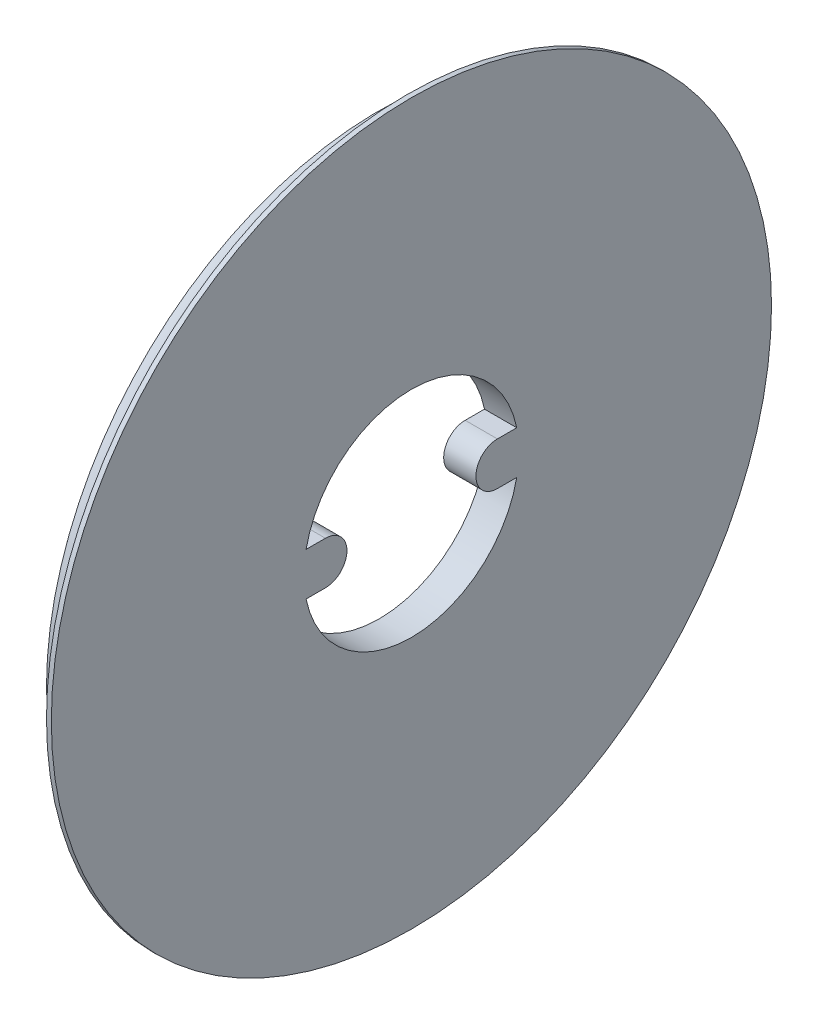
ISO-10303-21;
HEADER;
FILE_DESCRIPTION(('STEP AP214'),'2;1');
FILE_NAME('part.step','',(''),(''),'','','');
FILE_SCHEMA(('AUTOMOTIVE_DESIGN { 1 0 10303 214 1 1 1 1 }'));
ENDSEC;
DATA;
#1=APPLICATION_CONTEXT('core data for automotive mechanical design processes');
#2=APPLICATION_PROTOCOL_DEFINITION('international standard','automotive_design',2000,#1);
#3=PRODUCT_CONTEXT('',#1,'mechanical');
#4=PRODUCT('Part','Part','',(#3));
#5=PRODUCT_RELATED_PRODUCT_CATEGORY('part','',(#4));
#6=PRODUCT_DEFINITION_FORMATION('','',#4);
#7=PRODUCT_DEFINITION_CONTEXT('part definition',#1,'design');
#8=PRODUCT_DEFINITION('design','',#6,#7);
#9=PRODUCT_DEFINITION_SHAPE('','',#8);
#10=(LENGTH_UNIT() NAMED_UNIT(*) SI_UNIT(.MILLI.,.METRE.));
#11=(NAMED_UNIT(*) PLANE_ANGLE_UNIT() SI_UNIT($,.RADIAN.));
#12=(NAMED_UNIT(*) SI_UNIT($,.STERADIAN.) SOLID_ANGLE_UNIT());
#13=UNCERTAINTY_MEASURE_WITH_UNIT(LENGTH_MEASURE(1.E-05),#10,'distance_accuracy_value','');
#14=(GEOMETRIC_REPRESENTATION_CONTEXT(3) GLOBAL_UNCERTAINTY_ASSIGNED_CONTEXT((#13)) GLOBAL_UNIT_ASSIGNED_CONTEXT((#10,
#11,#12)) REPRESENTATION_CONTEXT('',''));
#15=CARTESIAN_POINT('',(0.,0.,0.));
#16=DIRECTION('',(0.,0.,1.));
#17=DIRECTION('',(1.,0.,0.));
#18=AXIS2_PLACEMENT_3D('',#15,#16,#17);
#19=CARTESIAN_POINT('',(11.9999999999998,66.9999999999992,0.));
#20=DIRECTION('',(1.,0.,0.));
#21=DIRECTION('',(0.,0.,-1.));
#22=AXIS2_PLACEMENT_3D('',#19,#20,#21);
#23=PLANE('',#22);
#24=CARTESIAN_POINT('',(11.9999999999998,0.,-16.));
#25=DIRECTION('',(1.,0.,0.));
#26=DIRECTION('',(0.,0.,1.));
#27=AXIS2_PLACEMENT_3D('',#24,#25,#26);
#28=CIRCLE('',#27,4.);
#29=CARTESIAN_POINT('',(11.9999999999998,4.,-16.));
#30=VERTEX_POINT('',#29);
#31=CARTESIAN_POINT('',(11.9999999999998,-4.,-16.));
#32=VERTEX_POINT('',#31);
#33=EDGE_CURVE('E103',#30,#32,#28,.T.);
#34=ORIENTED_EDGE('',*,*,#33,.T.);
#35=DIRECTION('',(0.,0.,-1.));
#36=VECTOR('',#35,1.);
#37=CARTESIAN_POINT('',(11.9999999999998,-4.,-19.5959179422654));
#38=LINE('',#37,#36);
#39=CARTESIAN_POINT('',(11.9999999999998,-4.,-19.5959179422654));
#40=VERTEX_POINT('',#39);
#41=EDGE_CURVE('E112',#32,#40,#38,.T.);
#42=ORIENTED_EDGE('',*,*,#41,.T.);
#43=CARTESIAN_POINT('',(11.9999999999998,0.,0.));
#44=DIRECTION('',(-1.,0.,0.));
#45=DIRECTION('',(0.,0.,1.));
#46=AXIS2_PLACEMENT_3D('',#43,#44,#45);
#47=CIRCLE('',#46,20.);
#48=CARTESIAN_POINT('',(11.9999999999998,-4.,19.5959179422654));
#49=VERTEX_POINT('',#48);
#50=EDGE_CURVE('E51',#40,#49,#47,.T.);
#51=ORIENTED_EDGE('',*,*,#50,.T.);
#52=DIRECTION('',(0.,0.,-1.));
#53=VECTOR('',#52,1.);
#54=CARTESIAN_POINT('',(11.9999999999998,-4.,19.5959179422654));
#55=LINE('',#54,#53);
#56=CARTESIAN_POINT('',(11.9999999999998,-4.,16.));
#57=VERTEX_POINT('',#56);
#58=EDGE_CURVE('E129',#49,#57,#55,.T.);
#59=ORIENTED_EDGE('',*,*,#58,.T.);
#60=CARTESIAN_POINT('',(11.9999999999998,0.,16.));
#61=DIRECTION('',(1.,0.,0.));
#62=DIRECTION('',(0.,0.,-1.));
#63=AXIS2_PLACEMENT_3D('',#60,#61,#62);
#64=CIRCLE('',#63,4.);
#65=CARTESIAN_POINT('',(11.9999999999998,4.,16.));
#66=VERTEX_POINT('',#65);
#67=EDGE_CURVE('E132',#57,#66,#64,.T.);
#68=ORIENTED_EDGE('',*,*,#67,.T.);
#69=DIRECTION('',(0.,0.,1.));
#70=VECTOR('',#69,1.);
#71=CARTESIAN_POINT('',(11.9999999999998,4.,19.5959179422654));
#72=LINE('',#71,#70);
#73=CARTESIAN_POINT('',(11.9999999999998,4.,19.5959179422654));
#74=VERTEX_POINT('',#73);
#75=EDGE_CURVE('E135',#66,#74,#72,.T.);
#76=ORIENTED_EDGE('',*,*,#75,.T.);
#77=CARTESIAN_POINT('',(11.9999999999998,0.,0.));
#78=DIRECTION('',(-1.,0.,0.));
#79=DIRECTION('',(0.,0.,1.));
#80=AXIS2_PLACEMENT_3D('',#77,#78,#79);
#81=CIRCLE('',#80,20.);
#82=CARTESIAN_POINT('',(11.9999999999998,4.,-19.5959179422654));
#83=VERTEX_POINT('',#82);
#84=EDGE_CURVE('E138',#74,#83,#81,.T.);
#85=ORIENTED_EDGE('',*,*,#84,.T.);
#86=DIRECTION('',(0.,0.,1.));
#87=VECTOR('',#86,1.);
#88=CARTESIAN_POINT('',(11.9999999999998,4.,-19.5959179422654));
#89=LINE('',#88,#87);
#90=EDGE_CURVE('E109',#83,#30,#89,.T.);
#91=ORIENTED_EDGE('',*,*,#90,.T.);
#92=EDGE_LOOP('',(#34,#42,#51,#59,#68,#76,#85,#91));
#93=FACE_BOUND('',#92,.T.);
#94=CARTESIAN_POINT('',(11.9999999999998,-7.77547884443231E-13,0.));
#95=DIRECTION('',(-1.,0.,0.));
#96=DIRECTION('',(0.,0.,1.));
#97=AXIS2_PLACEMENT_3D('',#94,#95,#96);
#98=CIRCLE('',#97,67.);
#99=CARTESIAN_POINT('',(11.9999999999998,-7.77547884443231E-13,67.));
#100=VERTEX_POINT('',#99);
#101=EDGE_CURVE('E11',#100,#100,#98,.T.);
#102=ORIENTED_EDGE('',*,*,#101,.F.);
#103=EDGE_LOOP('',(#102));
#104=FACE_BOUND('',#103,.T.);
#105=ADVANCED_FACE('F37',(#93,#104),#23,.T.);
#106=CARTESIAN_POINT('',(-19.0782144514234,-7.77547884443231E-13,0.));
#107=DIRECTION('',(-1.,0.,0.));
#108=DIRECTION('',(0.,0.,1.));
#109=AXIS2_PLACEMENT_3D('',#106,#107,#108);
#110=CYLINDRICAL_SURFACE('',#109,67.);
#111=ORIENTED_EDGE('',*,*,#101,.T.);
#112=EDGE_LOOP('',(#111));
#113=FACE_BOUND('',#112,.T.);
#114=CARTESIAN_POINT('',(11.0999999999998,-7.77547884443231E-13,0.));
#115=DIRECTION('',(-1.,0.,0.));
#116=DIRECTION('',(0.,0.,1.));
#117=AXIS2_PLACEMENT_3D('',#114,#115,#116);
#118=CIRCLE('',#117,67.);
#119=CARTESIAN_POINT('',(11.0999999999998,-7.77547884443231E-13,67.));
#120=VERTEX_POINT('',#119);
#121=EDGE_CURVE('E44',#120,#120,#118,.T.);
#122=ORIENTED_EDGE('',*,*,#121,.F.);
#123=EDGE_LOOP('',(#122));
#124=FACE_BOUND('',#123,.T.);
#125=ADVANCED_FACE('F180',(#113,#124),#110,.T.);
#126=CARTESIAN_POINT('',(5.99999999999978,-7.7715611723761E-13,0.));
#127=DIRECTION('',(-1.,0.,0.));
#128=DIRECTION('',(0.,0.,1.));
#129=AXIS2_PLACEMENT_3D('',#126,#127,#128);
#130=TOROIDAL_SURFACE('',#129,67.,5.1);
#131=ORIENTED_EDGE('',*,*,#121,.T.);
#132=EDGE_LOOP('',(#131));
#133=FACE_BOUND('',#132,.T.);
#134=CARTESIAN_POINT('',(5.99999999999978,-7.77547884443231E-13,0.));
#135=DIRECTION('',(-1.,0.,0.));
#136=DIRECTION('',(0.,0.,1.));
#137=AXIS2_PLACEMENT_3D('',#134,#135,#136);
#138=CIRCLE('',#137,61.9);
#139=CARTESIAN_POINT('',(5.99999999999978,-7.77547884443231E-13,61.9));
#140=VERTEX_POINT('',#139);
#141=EDGE_CURVE('E161',#140,#140,#138,.T.);
#142=ORIENTED_EDGE('',*,*,#141,.F.);
#143=EDGE_LOOP('',(#142));
#144=FACE_BOUND('',#143,.T.);
#145=ADVANCED_FACE('F177',(#133,#144),#130,.F.);
#146=CARTESIAN_POINT('',(5.99999999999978,61.8999999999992,0.));
#147=DIRECTION('',(1.,0.,0.));
#148=DIRECTION('',(0.,0.,-1.));
#149=AXIS2_PLACEMENT_3D('',#146,#147,#148);
#150=PLANE('',#149);
#151=CARTESIAN_POINT('',(5.99999999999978,15.0000000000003,-25.980762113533));
#152=DIRECTION('',(-1.,0.,0.));
#153=DIRECTION('',(0.,0.,1.));
#154=AXIS2_PLACEMENT_3D('',#151,#152,#153);
#155=CIRCLE('',#154,1.1);
#156=CARTESIAN_POINT('',(5.99999999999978,15.0000000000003,-24.880762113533));
#157=VERTEX_POINT('',#156);
#158=EDGE_CURVE('E273',#157,#157,#155,.T.);
#159=ORIENTED_EDGE('',*,*,#158,.F.);
#160=EDGE_LOOP('',(#159));
#161=FACE_BOUND('',#160,.T.);
#162=CARTESIAN_POINT('',(5.99999999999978,-15.0000000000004,-25.9807621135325));
#163=DIRECTION('',(-1.,0.,0.));
#164=DIRECTION('',(0.,0.,1.));
#165=AXIS2_PLACEMENT_3D('',#162,#163,#164);
#166=CIRCLE('',#165,1.100000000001);
#167=CARTESIAN_POINT('',(5.99999999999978,-15.0000000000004,-24.8807621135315));
#168=VERTEX_POINT('',#167);
#169=EDGE_CURVE('E272',#168,#168,#166,.T.);
#170=ORIENTED_EDGE('',*,*,#169,.F.);
#171=EDGE_LOOP('',(#170));
#172=FACE_BOUND('',#171,.T.);
#173=CARTESIAN_POINT('',(5.99999999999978,-30.,8.52170513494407E-13));
#174=DIRECTION('',(-1.,0.,0.));
#175=DIRECTION('',(0.,0.,1.));
#176=AXIS2_PLACEMENT_3D('',#173,#174,#175);
#177=CIRCLE('',#176,1.10000000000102);
#178=CARTESIAN_POINT('',(5.99999999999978,-30.,1.10000000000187));
#179=VERTEX_POINT('',#178);
#180=EDGE_CURVE('E282',#179,#179,#177,.T.);
#181=ORIENTED_EDGE('',*,*,#180,.F.);
#182=EDGE_LOOP('',(#181));
#183=FACE_BOUND('',#182,.T.);
#184=CARTESIAN_POINT('',(5.99999999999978,-15.0000000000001,25.9807621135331));
#185=DIRECTION('',(-1.,0.,0.));
#186=DIRECTION('',(0.,0.,1.));
#187=AXIS2_PLACEMENT_3D('',#184,#185,#186);
#188=CIRCLE('',#187,1.1);
#189=CARTESIAN_POINT('',(5.99999999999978,-15.0000000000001,27.0807621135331));
#190=VERTEX_POINT('',#189);
#191=EDGE_CURVE('E287',#190,#190,#188,.T.);
#192=ORIENTED_EDGE('',*,*,#191,.F.);
#193=EDGE_LOOP('',(#192));
#194=FACE_BOUND('',#193,.T.);
#195=CARTESIAN_POINT('',(5.99999999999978,14.9999999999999,25.9807621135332));
#196=DIRECTION('',(-1.,0.,0.));
#197=DIRECTION('',(0.,0.,1.));
#198=AXIS2_PLACEMENT_3D('',#195,#196,#197);
#199=CIRCLE('',#198,1.1);
#200=CARTESIAN_POINT('',(5.99999999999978,14.9999999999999,27.0807621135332));
#201=VERTEX_POINT('',#200);
#202=EDGE_CURVE('E293',#201,#201,#199,.T.);
#203=ORIENTED_EDGE('',*,*,#202,.F.);
#204=EDGE_LOOP('',(#203));
#205=FACE_BOUND('',#204,.T.);
#206=CARTESIAN_POINT('',(5.99999999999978,30.,0.));
#207=DIRECTION('',(-1.,0.,0.));
#208=DIRECTION('',(0.,0.,1.));
#209=AXIS2_PLACEMENT_3D('',#206,#207,#208);
#210=CIRCLE('',#209,1.1);
#211=CARTESIAN_POINT('',(5.99999999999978,30.,1.1));
#212=VERTEX_POINT('',#211);
#213=EDGE_CURVE('E125',#212,#212,#210,.T.);
#214=ORIENTED_EDGE('',*,*,#213,.F.);
#215=EDGE_LOOP('',(#214));
#216=FACE_BOUND('',#215,.T.);
#217=DIRECTION('',(0.,0.,-1.));
#218=VECTOR('',#217,1.);
#219=CARTESIAN_POINT('',(5.99999999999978,-4.,-19.5959179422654));
#220=LINE('',#219,#218);
#221=CARTESIAN_POINT('',(5.99999999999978,-4.,-16.));
#222=VERTEX_POINT('',#221);
#223=CARTESIAN_POINT('',(5.99999999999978,-4.,-19.5959179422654));
#224=VERTEX_POINT('',#223);
#225=EDGE_CURVE('E142',#222,#224,#220,.T.);
#226=ORIENTED_EDGE('',*,*,#225,.F.);
#227=CARTESIAN_POINT('',(5.99999999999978,0.,-16.));
#228=DIRECTION('',(1.,0.,0.));
#229=DIRECTION('',(0.,0.,1.));
#230=AXIS2_PLACEMENT_3D('',#227,#228,#229);
#231=CIRCLE('',#230,4.);
#232=CARTESIAN_POINT('',(5.99999999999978,4.,-16.));
#233=VERTEX_POINT('',#232);
#234=EDGE_CURVE('E59',#233,#222,#231,.T.);
#235=ORIENTED_EDGE('',*,*,#234,.F.);
#236=DIRECTION('',(0.,0.,1.));
#237=VECTOR('',#236,1.);
#238=CARTESIAN_POINT('',(5.99999999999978,4.,-19.5959179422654));
#239=LINE('',#238,#237);
#240=CARTESIAN_POINT('',(5.99999999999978,4.,-19.5959179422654));
#241=VERTEX_POINT('',#240);
#242=EDGE_CURVE('E119',#241,#233,#239,.T.);
#243=ORIENTED_EDGE('',*,*,#242,.F.);
#244=CARTESIAN_POINT('',(5.99999999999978,0.,0.));
#245=DIRECTION('',(-1.,0.,0.));
#246=DIRECTION('',(0.,0.,1.));
#247=AXIS2_PLACEMENT_3D('',#244,#245,#246);
#248=CIRCLE('',#247,20.);
#249=CARTESIAN_POINT('',(5.99999999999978,4.,19.5959179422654));
#250=VERTEX_POINT('',#249);
#251=EDGE_CURVE('E122',#250,#241,#248,.T.);
#252=ORIENTED_EDGE('',*,*,#251,.F.);
#253=DIRECTION('',(0.,0.,1.));
#254=VECTOR('',#253,1.);
#255=CARTESIAN_POINT('',(5.99999999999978,4.,19.5959179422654));
#256=LINE('',#255,#254);
#257=CARTESIAN_POINT('',(5.99999999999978,4.,16.));
#258=VERTEX_POINT('',#257);
#259=EDGE_CURVE('E154',#258,#250,#256,.T.);
#260=ORIENTED_EDGE('',*,*,#259,.F.);
#261=CARTESIAN_POINT('',(5.99999999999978,0.,16.));
#262=DIRECTION('',(1.,0.,0.));
#263=DIRECTION('',(0.,0.,-1.));
#264=AXIS2_PLACEMENT_3D('',#261,#262,#263);
#265=CIRCLE('',#264,4.);
#266=CARTESIAN_POINT('',(5.99999999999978,-4.,16.));
#267=VERTEX_POINT('',#266);
#268=EDGE_CURVE('E151',#267,#258,#265,.T.);
#269=ORIENTED_EDGE('',*,*,#268,.F.);
#270=DIRECTION('',(0.,0.,-1.));
#271=VECTOR('',#270,1.);
#272=CARTESIAN_POINT('',(5.99999999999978,-4.,19.5959179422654));
#273=LINE('',#272,#271);
#274=CARTESIAN_POINT('',(5.99999999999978,-4.,19.5959179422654));
#275=VERTEX_POINT('',#274);
#276=EDGE_CURVE('E148',#275,#267,#273,.T.);
#277=ORIENTED_EDGE('',*,*,#276,.F.);
#278=CARTESIAN_POINT('',(5.99999999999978,0.,0.));
#279=DIRECTION('',(-1.,0.,0.));
#280=DIRECTION('',(0.,0.,1.));
#281=AXIS2_PLACEMENT_3D('',#278,#279,#280);
#282=CIRCLE('',#281,20.);
#283=EDGE_CURVE('E145',#224,#275,#282,.T.);
#284=ORIENTED_EDGE('',*,*,#283,.F.);
#285=EDGE_LOOP('',(#226,#235,#243,#252,#260,#269,#277,#284));
#286=FACE_BOUND('',#285,.T.);
#287=ORIENTED_EDGE('',*,*,#141,.T.);
#288=EDGE_LOOP('',(#287));
#289=FACE_BOUND('',#288,.T.);
#290=ADVANCED_FACE('F187',(#161,#172,#183,#194,#205,#216,#286,#289),#150,.F.);
#291=CARTESIAN_POINT('',(11.9999999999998,0.,-16.));
#292=DIRECTION('',(-1.,0.,0.));
#293=DIRECTION('',(0.,0.,1.));
#294=AXIS2_PLACEMENT_3D('',#291,#292,#293);
#295=CYLINDRICAL_SURFACE('',#294,4.);
#296=ORIENTED_EDGE('',*,*,#234,.T.);
#297=DIRECTION('',(-1.,0.,0.));
#298=VECTOR('',#297,1.);
#299=CARTESIAN_POINT('',(11.9999999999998,-4.,-16.));
#300=LINE('',#299,#298);
#301=EDGE_CURVE('E99',#32,#222,#300,.T.);
#302=ORIENTED_EDGE('',*,*,#301,.F.);
#303=ORIENTED_EDGE('',*,*,#33,.F.);
#304=DIRECTION('',(-1.,0.,0.));
#305=VECTOR('',#304,1.);
#306=CARTESIAN_POINT('',(11.9999999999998,4.,-16.));
#307=LINE('',#306,#305);
#308=EDGE_CURVE('E159',#30,#233,#307,.T.);
#309=ORIENTED_EDGE('',*,*,#308,.T.);
#310=EDGE_LOOP('',(#296,#302,#303,#309));
#311=FACE_BOUND('',#310,.T.);
#312=ADVANCED_FACE('F101',(#311),#295,.T.);
#313=CARTESIAN_POINT('',(11.9999999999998,4.,-19.5959179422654));
#314=DIRECTION('',(0.,-1.,0.));
#315=DIRECTION('',(0.,0.,-1.));
#316=AXIS2_PLACEMENT_3D('',#313,#314,#315);
#317=PLANE('',#316);
#318=ORIENTED_EDGE('',*,*,#242,.T.);
#319=ORIENTED_EDGE('',*,*,#308,.F.);
#320=ORIENTED_EDGE('',*,*,#90,.F.);
#321=DIRECTION('',(-1.,0.,0.));
#322=VECTOR('',#321,1.);
#323=CARTESIAN_POINT('',(11.9999999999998,4.,-19.5959179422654));
#324=LINE('',#323,#322);
#325=EDGE_CURVE('E162',#83,#241,#324,.T.);
#326=ORIENTED_EDGE('',*,*,#325,.T.);
#327=EDGE_LOOP('',(#318,#319,#320,#326));
#328=FACE_BOUND('',#327,.T.);
#329=ADVANCED_FACE('F195',(#328),#317,.F.);
#330=CARTESIAN_POINT('',(11.9999999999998,0.,0.));
#331=DIRECTION('',(-1.,0.,0.));
#332=DIRECTION('',(0.,0.,1.));
#333=AXIS2_PLACEMENT_3D('',#330,#331,#332);
#334=CYLINDRICAL_SURFACE('',#333,20.);
#335=ORIENTED_EDGE('',*,*,#251,.T.);
#336=ORIENTED_EDGE('',*,*,#325,.F.);
#337=ORIENTED_EDGE('',*,*,#84,.F.);
#338=DIRECTION('',(-1.,0.,0.));
#339=VECTOR('',#338,1.);
#340=CARTESIAN_POINT('',(11.9999999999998,4.,19.5959179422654));
#341=LINE('',#340,#339);
#342=EDGE_CURVE('E164',#74,#250,#341,.T.);
#343=ORIENTED_EDGE('',*,*,#342,.T.);
#344=EDGE_LOOP('',(#335,#336,#337,#343));
#345=FACE_BOUND('',#344,.T.);
#346=ADVANCED_FACE('F213',(#345),#334,.F.);
#347=CARTESIAN_POINT('',(11.9999999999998,4.,19.5959179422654));
#348=DIRECTION('',(0.,-1.,0.));
#349=DIRECTION('',(0.,0.,-1.));
#350=AXIS2_PLACEMENT_3D('',#347,#348,#349);
#351=PLANE('',#350);
#352=ORIENTED_EDGE('',*,*,#259,.T.);
#353=ORIENTED_EDGE('',*,*,#342,.F.);
#354=ORIENTED_EDGE('',*,*,#75,.F.);
#355=DIRECTION('',(-1.,0.,0.));
#356=VECTOR('',#355,1.);
#357=CARTESIAN_POINT('',(11.9999999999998,4.,16.));
#358=LINE('',#357,#356);
#359=EDGE_CURVE('E166',#66,#258,#358,.T.);
#360=ORIENTED_EDGE('',*,*,#359,.T.);
#361=EDGE_LOOP('',(#352,#353,#354,#360));
#362=FACE_BOUND('',#361,.T.);
#363=ADVANCED_FACE('F209',(#362),#351,.F.);
#364=CARTESIAN_POINT('',(11.9999999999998,0.,16.));
#365=DIRECTION('',(-1.,0.,0.));
#366=DIRECTION('',(0.,0.,1.));
#367=AXIS2_PLACEMENT_3D('',#364,#365,#366);
#368=CYLINDRICAL_SURFACE('',#367,4.);
#369=ORIENTED_EDGE('',*,*,#268,.T.);
#370=ORIENTED_EDGE('',*,*,#359,.F.);
#371=ORIENTED_EDGE('',*,*,#67,.F.);
#372=DIRECTION('',(-1.,0.,0.));
#373=VECTOR('',#372,1.);
#374=CARTESIAN_POINT('',(11.9999999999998,-4.,16.));
#375=LINE('',#374,#373);
#376=EDGE_CURVE('E168',#57,#267,#375,.T.);
#377=ORIENTED_EDGE('',*,*,#376,.T.);
#378=EDGE_LOOP('',(#369,#370,#371,#377));
#379=FACE_BOUND('',#378,.T.);
#380=ADVANCED_FACE('F205',(#379),#368,.T.);
#381=CARTESIAN_POINT('',(11.9999999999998,-4.,19.5959179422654));
#382=DIRECTION('',(0.,1.,0.));
#383=DIRECTION('',(0.,0.,1.));
#384=AXIS2_PLACEMENT_3D('',#381,#382,#383);
#385=PLANE('',#384);
#386=ORIENTED_EDGE('',*,*,#276,.T.);
#387=ORIENTED_EDGE('',*,*,#376,.F.);
#388=ORIENTED_EDGE('',*,*,#58,.F.);
#389=DIRECTION('',(-1.,0.,0.));
#390=VECTOR('',#389,1.);
#391=CARTESIAN_POINT('',(11.9999999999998,-4.,19.5959179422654));
#392=LINE('',#391,#390);
#393=EDGE_CURVE('E170',#49,#275,#392,.T.);
#394=ORIENTED_EDGE('',*,*,#393,.T.);
#395=EDGE_LOOP('',(#386,#387,#388,#394));
#396=FACE_BOUND('',#395,.T.);
#397=ADVANCED_FACE('F202',(#396),#385,.F.);
#398=CARTESIAN_POINT('',(11.9999999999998,0.,0.));
#399=DIRECTION('',(-1.,0.,0.));
#400=DIRECTION('',(0.,0.,1.));
#401=AXIS2_PLACEMENT_3D('',#398,#399,#400);
#402=CYLINDRICAL_SURFACE('',#401,20.);
#403=ORIENTED_EDGE('',*,*,#283,.T.);
#404=ORIENTED_EDGE('',*,*,#393,.F.);
#405=ORIENTED_EDGE('',*,*,#50,.F.);
#406=DIRECTION('',(-1.,0.,0.));
#407=VECTOR('',#406,1.);
#408=CARTESIAN_POINT('',(11.9999999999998,-4.,-19.5959179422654));
#409=LINE('',#408,#407);
#410=EDGE_CURVE('E108',#40,#224,#409,.T.);
#411=ORIENTED_EDGE('',*,*,#410,.T.);
#412=EDGE_LOOP('',(#403,#404,#405,#411));
#413=FACE_BOUND('',#412,.T.);
#414=ADVANCED_FACE('F199',(#413),#402,.F.);
#415=CARTESIAN_POINT('',(11.9999999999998,-4.,-19.5959179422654));
#416=DIRECTION('',(0.,1.,0.));
#417=DIRECTION('',(0.,0.,1.));
#418=AXIS2_PLACEMENT_3D('',#415,#416,#417);
#419=PLANE('',#418);
#420=ORIENTED_EDGE('',*,*,#225,.T.);
#421=ORIENTED_EDGE('',*,*,#410,.F.);
#422=ORIENTED_EDGE('',*,*,#41,.F.);
#423=ORIENTED_EDGE('',*,*,#301,.T.);
#424=EDGE_LOOP('',(#420,#421,#422,#423));
#425=FACE_BOUND('',#424,.T.);
#426=ADVANCED_FACE('F113',(#425),#419,.F.);
#427=CARTESIAN_POINT('',(9.99999999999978,30.,0.));
#428=DIRECTION('',(-1.,0.,0.));
#429=DIRECTION('',(0.,0.,1.));
#430=AXIS2_PLACEMENT_3D('',#427,#428,#429);
#431=CYLINDRICAL_SURFACE('',#430,1.1);
#432=CARTESIAN_POINT('',(9.99999999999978,30.,0.));
#433=DIRECTION('',(-1.,0.,0.));
#434=DIRECTION('',(0.,0.,1.));
#435=AXIS2_PLACEMENT_3D('',#432,#433,#434);
#436=CIRCLE('',#435,1.1);
#437=CARTESIAN_POINT('',(9.99999999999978,30.,1.1));
#438=VERTEX_POINT('',#437);
#439=EDGE_CURVE('E143',#438,#438,#436,.T.);
#440=ORIENTED_EDGE('',*,*,#439,.F.);
#441=EDGE_LOOP('',(#440));
#442=FACE_BOUND('',#441,.T.);
#443=ORIENTED_EDGE('',*,*,#213,.T.);
#444=EDGE_LOOP('',(#443));
#445=FACE_BOUND('',#444,.T.);
#446=ADVANCED_FACE('F198',(#442,#445),#431,.F.);
#447=CARTESIAN_POINT('',(9.99999999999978,30.,0.));
#448=DIRECTION('',(-1.,0.,0.));
#449=DIRECTION('',(0.,0.,1.));
#450=AXIS2_PLACEMENT_3D('',#447,#448,#449);
#451=PLANE('',#450);
#452=ORIENTED_EDGE('',*,*,#439,.T.);
#453=EDGE_LOOP('',(#452));
#454=FACE_BOUND('',#453,.T.);
#455=ADVANCED_FACE('F223',(#454),#451,.T.);
#456=CARTESIAN_POINT('',(9.99999999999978,14.9999999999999,25.9807621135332));
#457=DIRECTION('',(-1.,0.,0.));
#458=DIRECTION('',(0.,0.,1.));
#459=AXIS2_PLACEMENT_3D('',#456,#457,#458);
#460=CYLINDRICAL_SURFACE('',#459,1.1);
#461=CARTESIAN_POINT('',(9.99999999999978,14.9999999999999,25.9807621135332));
#462=DIRECTION('',(-1.,0.,0.));
#463=DIRECTION('',(0.,0.,1.));
#464=AXIS2_PLACEMENT_3D('',#461,#462,#463);
#465=CIRCLE('',#464,1.1);
#466=CARTESIAN_POINT('',(9.99999999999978,14.9999999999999,27.0807621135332));
#467=VERTEX_POINT('',#466);
#468=EDGE_CURVE('E296',#467,#467,#465,.T.);
#469=ORIENTED_EDGE('',*,*,#468,.F.);
#470=EDGE_LOOP('',(#469));
#471=FACE_BOUND('',#470,.T.);
#472=ORIENTED_EDGE('',*,*,#202,.T.);
#473=EDGE_LOOP('',(#472));
#474=FACE_BOUND('',#473,.T.);
#475=ADVANCED_FACE('F227',(#471,#474),#460,.F.);
#476=CARTESIAN_POINT('',(9.99999999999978,14.9999999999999,25.9807621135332));
#477=DIRECTION('',(-1.,0.,0.));
#478=DIRECTION('',(0.,0.,1.));
#479=AXIS2_PLACEMENT_3D('',#476,#477,#478);
#480=PLANE('',#479);
#481=ORIENTED_EDGE('',*,*,#468,.T.);
#482=EDGE_LOOP('',(#481));
#483=FACE_BOUND('',#482,.T.);
#484=ADVANCED_FACE('F231',(#483),#480,.T.);
#485=CARTESIAN_POINT('',(9.99999999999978,-15.0000000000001,25.9807621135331));
#486=DIRECTION('',(-1.,0.,0.));
#487=DIRECTION('',(0.,0.,1.));
#488=AXIS2_PLACEMENT_3D('',#485,#486,#487);
#489=CYLINDRICAL_SURFACE('',#488,1.1);
#490=CARTESIAN_POINT('',(9.99999999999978,-15.0000000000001,25.9807621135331));
#491=DIRECTION('',(-1.,0.,0.));
#492=DIRECTION('',(0.,0.,1.));
#493=AXIS2_PLACEMENT_3D('',#490,#491,#492);
#494=CIRCLE('',#493,1.1);
#495=CARTESIAN_POINT('',(9.99999999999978,-15.0000000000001,27.0807621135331));
#496=VERTEX_POINT('',#495);
#497=EDGE_CURVE('E290',#496,#496,#494,.T.);
#498=ORIENTED_EDGE('',*,*,#497,.F.);
#499=EDGE_LOOP('',(#498));
#500=FACE_BOUND('',#499,.T.);
#501=ORIENTED_EDGE('',*,*,#191,.T.);
#502=EDGE_LOOP('',(#501));
#503=FACE_BOUND('',#502,.T.);
#504=ADVANCED_FACE('F235',(#500,#503),#489,.F.);
#505=CARTESIAN_POINT('',(9.99999999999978,-15.0000000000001,25.9807621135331));
#506=DIRECTION('',(-1.,0.,0.));
#507=DIRECTION('',(0.,0.,1.));
#508=AXIS2_PLACEMENT_3D('',#505,#506,#507);
#509=PLANE('',#508);
#510=ORIENTED_EDGE('',*,*,#497,.T.);
#511=EDGE_LOOP('',(#510));
#512=FACE_BOUND('',#511,.T.);
#513=ADVANCED_FACE('F239',(#512),#509,.T.);
#514=CARTESIAN_POINT('',(9.99999999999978,-30.,8.52170513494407E-13));
#515=DIRECTION('',(-1.,0.,0.));
#516=DIRECTION('',(0.,0.,1.));
#517=AXIS2_PLACEMENT_3D('',#514,#515,#516);
#518=CYLINDRICAL_SURFACE('',#517,1.10000000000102);
#519=CARTESIAN_POINT('',(9.99999999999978,-30.,8.52170513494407E-13));
#520=DIRECTION('',(-1.,0.,0.));
#521=DIRECTION('',(0.,0.,1.));
#522=AXIS2_PLACEMENT_3D('',#519,#520,#521);
#523=CIRCLE('',#522,1.10000000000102);
#524=CARTESIAN_POINT('',(9.99999999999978,-30.,1.10000000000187));
#525=VERTEX_POINT('',#524);
#526=EDGE_CURVE('E284',#525,#525,#523,.T.);
#527=ORIENTED_EDGE('',*,*,#526,.F.);
#528=EDGE_LOOP('',(#527));
#529=FACE_BOUND('',#528,.T.);
#530=ORIENTED_EDGE('',*,*,#180,.T.);
#531=EDGE_LOOP('',(#530));
#532=FACE_BOUND('',#531,.T.);
#533=ADVANCED_FACE('F243',(#529,#532),#518,.F.);
#534=CARTESIAN_POINT('',(9.99999999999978,-30.,8.52170513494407E-13));
#535=DIRECTION('',(-1.,0.,0.));
#536=DIRECTION('',(0.,0.,1.));
#537=AXIS2_PLACEMENT_3D('',#534,#535,#536);
#538=PLANE('',#537);
#539=ORIENTED_EDGE('',*,*,#526,.T.);
#540=EDGE_LOOP('',(#539));
#541=FACE_BOUND('',#540,.T.);
#542=ADVANCED_FACE('F247',(#541),#538,.T.);
#543=CARTESIAN_POINT('',(9.99999999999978,-15.0000000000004,-25.9807621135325));
#544=DIRECTION('',(-1.,0.,0.));
#545=DIRECTION('',(0.,0.,1.));
#546=AXIS2_PLACEMENT_3D('',#543,#544,#545);
#547=CYLINDRICAL_SURFACE('',#546,1.100000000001);
#548=CARTESIAN_POINT('',(9.99999999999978,-15.0000000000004,-25.9807621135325));
#549=DIRECTION('',(-1.,0.,0.));
#550=DIRECTION('',(0.,0.,1.));
#551=AXIS2_PLACEMENT_3D('',#548,#549,#550);
#552=CIRCLE('',#551,1.100000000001);
#553=CARTESIAN_POINT('',(9.99999999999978,-15.0000000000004,-24.8807621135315));
#554=VERTEX_POINT('',#553);
#555=EDGE_CURVE('E276',#554,#554,#552,.T.);
#556=ORIENTED_EDGE('',*,*,#555,.F.);
#557=EDGE_LOOP('',(#556));
#558=FACE_BOUND('',#557,.T.);
#559=ORIENTED_EDGE('',*,*,#169,.T.);
#560=EDGE_LOOP('',(#559));
#561=FACE_BOUND('',#560,.T.);
#562=ADVANCED_FACE('F251',(#558,#561),#547,.F.);
#563=CARTESIAN_POINT('',(9.99999999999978,-15.0000000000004,-25.9807621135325));
#564=DIRECTION('',(-1.,0.,0.));
#565=DIRECTION('',(0.,0.,1.));
#566=AXIS2_PLACEMENT_3D('',#563,#564,#565);
#567=PLANE('',#566);
#568=ORIENTED_EDGE('',*,*,#555,.T.);
#569=EDGE_LOOP('',(#568));
#570=FACE_BOUND('',#569,.T.);
#571=ADVANCED_FACE('F255',(#570),#567,.T.);
#572=CARTESIAN_POINT('',(9.99999999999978,15.0000000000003,-25.980762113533));
#573=DIRECTION('',(-1.,0.,0.));
#574=DIRECTION('',(0.,0.,1.));
#575=AXIS2_PLACEMENT_3D('',#572,#573,#574);
#576=CYLINDRICAL_SURFACE('',#575,1.1);
#577=CARTESIAN_POINT('',(9.99999999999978,15.0000000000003,-25.980762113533));
#578=DIRECTION('',(-1.,0.,0.));
#579=DIRECTION('',(0.,0.,1.));
#580=AXIS2_PLACEMENT_3D('',#577,#578,#579);
#581=CIRCLE('',#580,1.1);
#582=CARTESIAN_POINT('',(9.99999999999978,15.0000000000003,-24.880762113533));
#583=VERTEX_POINT('',#582);
#584=EDGE_CURVE('E271',#583,#583,#581,.T.);
#585=ORIENTED_EDGE('',*,*,#584,.F.);
#586=EDGE_LOOP('',(#585));
#587=FACE_BOUND('',#586,.T.);
#588=ORIENTED_EDGE('',*,*,#158,.T.);
#589=EDGE_LOOP('',(#588));
#590=FACE_BOUND('',#589,.T.);
#591=ADVANCED_FACE('F259',(#587,#590),#576,.F.);
#592=CARTESIAN_POINT('',(9.99999999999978,15.0000000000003,-25.980762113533));
#593=DIRECTION('',(-1.,0.,0.));
#594=DIRECTION('',(0.,0.,1.));
#595=AXIS2_PLACEMENT_3D('',#592,#593,#594);
#596=PLANE('',#595);
#597=ORIENTED_EDGE('',*,*,#584,.T.);
#598=EDGE_LOOP('',(#597));
#599=FACE_BOUND('',#598,.T.);
#600=ADVANCED_FACE('F263',(#599),#596,.T.);
#601=CLOSED_SHELL('',(#105,#125,#145,#290,#312,#329,#346,#363,#380,#397,#414,#426,#446,#455,
#475,#484,#504,#513,#533,#542,#562,#571,#591,#600));
#602=MANIFOLD_SOLID_BREP('B2',#601);
#603=ADVANCED_BREP_SHAPE_REPRESENTATION('',(#18,#602),#14);
#604=SHAPE_DEFINITION_REPRESENTATION(#9,#603);
ENDSEC;
END-ISO-10303-21;
